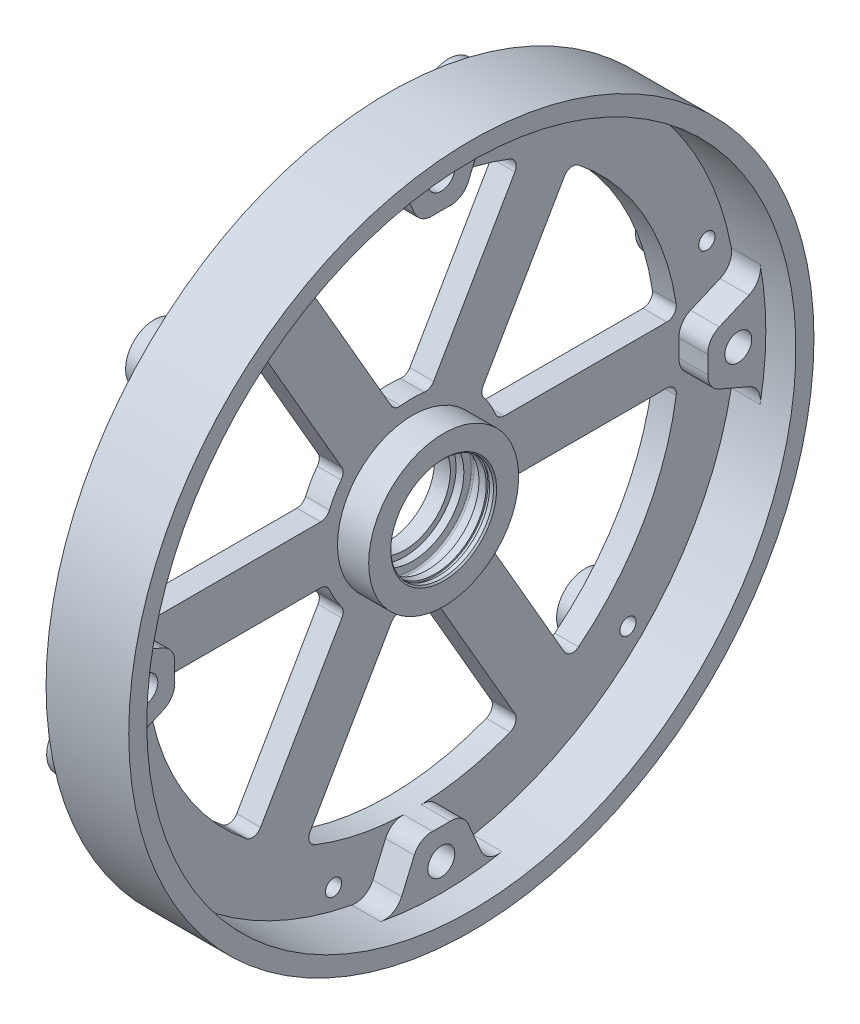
from build123d import *

# Parameters (mm, degrees)
CUT_EXTRUDE1_DEPTH             = 82.935418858
CIRPATTERN4_COUNT              = 6
M4_BOSS_EXTRUDE1_DEPTH         = 4.8006
CBORE_FOR_M4_SHCS1_D           = 4.5
CBORE_FOR_M4_SHCS1_CBORE_D     = 8
CBORE_FOR_M4_SHCS1_CBORE_DEPTH = 4
CIRPATTERN2_COUNT              = 4
SKETCH20_W                     = 0.56
SKETCH20_H                     = 0.2875
SKETCH22_R                     = 4.7625
EXTRUDE3_DEPTH                 = 3.175
CIRPATTERN6_COUNT              = 6
FILLET2_R                      = 1.5875
CHAMFER2_SIZE                  = 0.254


with BuildPart() as part:
    # Sketch1 → Revolve1 (revolve)
    with BuildSketch(Plane.XY, mode=Mode.PRIVATE) as revolve1_sk:
        Polygon((2.032, 54.102), (-7.77875, 54.102), (-7.77875, 12.5), (-2.5805, 12.5), (-2.5805, 8.5725), (-9.0805, 8.5725), (-9.0805, 7.62), (-11.7475, 7.62), (-11.7475, 57.1119), (2.032, 57.1119), align=None)
    revolve(revolve1_sk.sketch.rotate(Axis((0, 0, 0), (1, 0, 0)), 90), axis=Axis((0, 0, 0), (1, 0, 0)))

    # Sketch8 → Cut-Extrude1 (cut, through all)
    with BuildSketch(Plane.ZY.offset(11.7475)):
        with BuildLine():
            Line((2.980108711, 14.6866997), (17.972618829, 40.654488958))
            ThreePointArc((17.972618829, 40.654488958), (0, 44.45), (-17.972618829, 40.654488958))
            Line((-17.972618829, 40.654488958), (-2.980108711, 14.6866997))
            ThreePointArc((-2.980108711, 14.6866997), (0, 14.986), (2.980108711, 14.6866997))
        make_face()
    cut_extrude1 = extrude(amount=-CUT_EXTRUDE1_DEPTH, mode=Mode.SUBTRACT)

    # CirPattern4: Cut-Extrude1 ×6 about axis
    cirpattern4_axis = Axis((0, 0, 0), (1, 0, 0))
    for i in range(1, CIRPATTERN4_COUNT):
        add(cut_extrude1.rotate(cirpattern4_axis, i * 360 / CIRPATTERN4_COUNT), mode=Mode.SUBTRACT)

    # Sketch26 → M4 Boss-Extrude1 (add)
    with BuildSketch(Plane(origin=(-7.77875, 0, 0), x_dir=(0, 0, -1), z_dir=(1, 0, 0))):
        with BuildLine():
            Line((-6.606810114, 51.279245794), (-4.492989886, 46.348039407))
            ThreePointArc((-4.492989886, 46.348039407), (-3.278438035, 44.919731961), (-1.469813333, 44.42569244))
            ThreePointArc((-1.469813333, 44.42569244), (0, 44.45), (1.469813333, 44.42569244))
            ThreePointArc((1.469813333, 44.42569244), (3.278438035, 44.919731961), (4.492989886, 46.348039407))
            Line((4.492989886, 46.348039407), (6.606810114, 51.279245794))
            ThreePointArc((6.606810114, 51.279245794), (8.034002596, 52.831461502), (10.11882793, 53.147302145))
            ThreePointArc((10.11882793, 53.147302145), (0, 54.102), (-10.11882793, 53.147302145))
            ThreePointArc((-10.11882793, 53.147302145), (-8.034002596, 52.831461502), (-6.606810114, 51.279245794))
        make_face()
    m4_boss_extrude1 = extrude(amount=M4_BOSS_EXTRUDE1_DEPTH)

    # CBORE for M4 SHCS1 (through all)
    with Locations(Plane.ZY.offset(11.7475)):
        with Locations((0.003094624, 49.500027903)):
            cbore_for_m4_shcs1 = CounterBoreHole(CBORE_FOR_M4_SHCS1_D / 2, CBORE_FOR_M4_SHCS1_CBORE_D / 2, CBORE_FOR_M4_SHCS1_CBORE_DEPTH)

    # CirPattern2: M4 Boss-Extrude1, CBORE for M4 SHCS1 ×4 about axis
    cirpattern2_axis = Axis((0, 0, 0), (1, 0, 0))
    add([m4_boss_extrude1.rotate(cirpattern2_axis, i * 360 / CIRPATTERN2_COUNT) for i in range(1, CIRPATTERN2_COUNT)])
    add([cbore_for_m4_shcs1.rotate(cirpattern2_axis, i * 360 / CIRPATTERN2_COUNT) for i in range(1, CIRPATTERN2_COUNT)], mode=Mode.SUBTRACT)

    # Sketch20 → VHM-17 (revolve, cut)
    with BuildSketch(Plane.XY, mode=Mode.PRIVATE) as vhm_17_sk:
        with Locations((-3.7755, 8.71625)):
            Rectangle(SKETCH20_W, SKETCH20_H)
    revolve(vhm_17_sk.sketch.rotate(Axis((0.387355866, 0, 0), (1, 0, 0)), 90), axis=Axis((0.387355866, 0, 0), (1, 0, 0)), mode=Mode.SUBTRACT)

    # Sketch21 → 016 o-ring non-Stnd (revolve, cut)
    with BuildSketch(Plane.XY, mode=Mode.PRIVATE) as f_016_o_ring_non_stnd_sk:
        with BuildLine():
            Line((-7.854704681, -7.766725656), (-5.194380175, -7.766725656))
            Line((-5.194380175, -7.766725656), (-5.361257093, -9.674137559))
            ThreePointArc((-5.361257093, -9.674137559), (-5.442690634, -9.839268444), (-5.614290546, -9.906))
            Line((-5.614290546, -9.906), (-7.43479431, -9.906))
            ThreePointArc((-7.43479431, -9.906), (-7.606394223, -9.839268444), (-7.687827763, -9.674137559))
            Line((-7.687827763, -9.674137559), (-7.854704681, -7.766725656))
        make_face()
    revolve(f_016_o_ring_non_stnd_sk.sketch.rotate(Axis((0, 0, 0), (1, 0, 0)), 270), axis=Axis((0, 0, 0), (1, 0, 0)), mode=Mode.SUBTRACT)

    # Sketch22 → Extrude3 (add)
    with BuildSketch(Plane.ZY.offset(11.7475)):
        with Locations(Location((35.921024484, 35.921024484, 0), (0, 0, 180))):
            Circle(SKETCH22_R)
    extrude3 = extrude(amount=EXTRUDE3_DEPTH)

    # Sketch23 → 6-32 Tapped Hole1 (revolve, cut)
    with BuildSketch(Plane(origin=(-14.9225, 35.921024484, 35.921024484), x_dir=(0, 0, 1), z_dir=(0, 1, 0))):
        Polygon((0, 0), (0, 11.78549403), (1.35255, 10.9728), (1.35255, 0), align=None)
    f_6_32_tapped_hole1 = revolve(axis=Axis((-21.2725, 35.921024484, 35.921024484), (1, 0, 0)), mode=Mode.SUBTRACT)

    # CirPattern6: Extrude3, 6-32 Tapped Hole1 ×6 about axis
    cirpattern6_axis = Axis((0, 0, 0), (1, 0, 0))
    add([extrude3.rotate(cirpattern6_axis, i * 360 / CIRPATTERN6_COUNT) for i in range(1, CIRPATTERN6_COUNT)])
    add([f_6_32_tapped_hole1.rotate(cirpattern6_axis, i * 360 / CIRPATTERN6_COUNT) for i in range(1, CIRPATTERN6_COUNT)], mode=Mode.SUBTRACT)

    # Fillet2
    fillet2_edges = [part.edges().sort_by_distance(p)[0] for p in [
        (-9.763125, 4.7625, 14.209109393),
        (-9.763125, 9.9241997, 11.229000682),
        (-9.763125, 35.891988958, 26.221510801),
        (-9.763125, 4.7625, 44.19412963),
        (-9.763125, 14.6866997, 2.980108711),
        (-9.763125, 14.6866997, -2.980108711),
        (-9.763125, 40.654488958, -17.972618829),
        (-9.763125, 40.654488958, 17.972618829),
        (-9.763125, 9.9241997, -11.229000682),
        (-9.763125, 4.7625, -14.209109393),
        (-9.763125, 4.7625, -44.19412963),
        (-9.763125, 35.891988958, -26.221510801),
        (-9.763125, -4.7625, -14.209109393),
        (-9.763125, -9.9241997, -11.229000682),
        (-9.763125, -35.891988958, -26.221510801),
        (-9.763125, -4.7625, -44.19412963),
        (-9.763125, -14.6866997, -2.980108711),
        (-9.763125, -14.6866997, 2.980108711),
        (-9.763125, -40.654488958, 17.972618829),
        (-9.763125, -40.654488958, -17.972618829),
        (-9.763125, -9.9241997, 11.229000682),
        (-9.763125, -4.7625, 14.209109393),
        (-9.763125, -4.7625, 44.19412963),
        (-9.763125, -35.891988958, 26.221510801),
    ]]
    fillet(fillet2_edges, radius=FILLET2_R)

    # Chamfer2
    chamfer2_edges = [part.edges().sort_by_distance(p)[0] for p in [
        (-2.5805, 0, -8.5725),
    ]]
    chamfer(chamfer2_edges, length=CHAMFER2_SIZE)


solid = part.part
